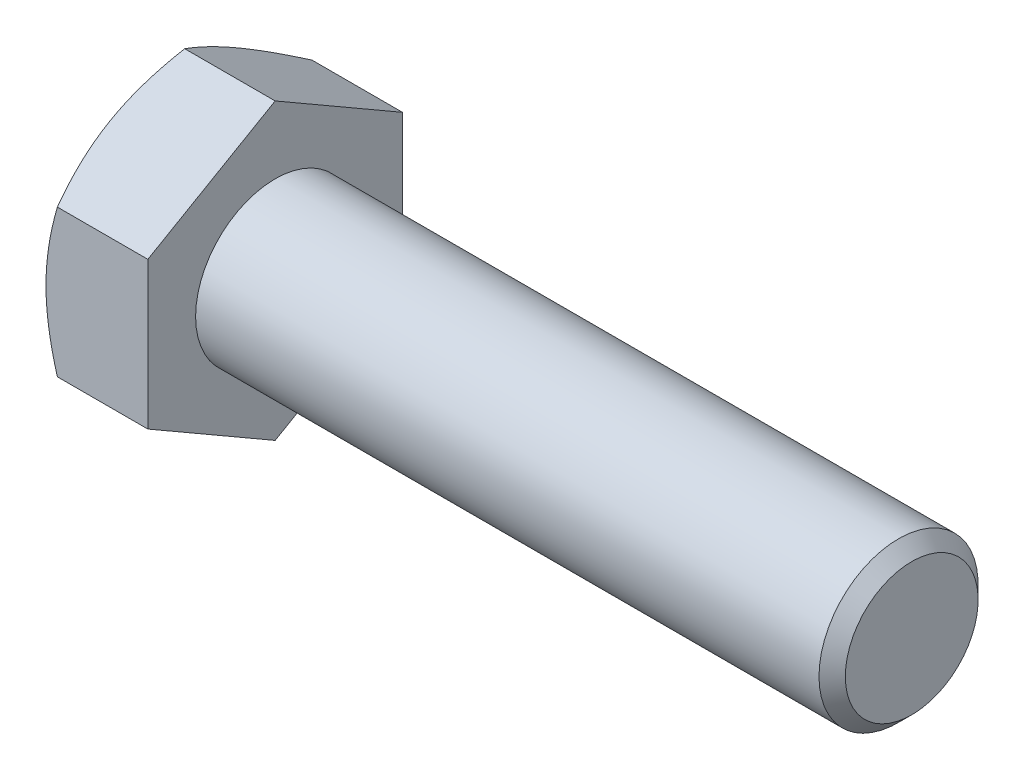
from build123d import *

# Parameters (mm, degrees)
BASEHEAD_DEPTH = 6.4


with BuildPart() as part:
    # Sketch1 → BaseHead (new body)
    with BuildSketch(Plane(origin=(0, 0, 0), x_dir=(0, 0, -1), z_dir=(1, 0, 0))):
        Polygon((8, 4.618802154), (8, -4.618802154), (0, -9.237604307), (-8, -4.618802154), (-8, 4.618802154), (0, 9.237604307), align=None)
    extrude(amount=BASEHEAD_DEPTH)

    # BodySke → BaseBody (revolve)
    with BuildSketch(Plane.XY, mode=Mode.PRIVATE) as basebody_sk:
        Polygon((0, 0), (46.4, 0), (46.4, 4.172), (45.572, 5), (0, 5), align=None)
    revolve(basebody_sk.sketch.rotate(Axis((0, 0, 0), (1, 0, 0)), 90), axis=Axis((0, 0, 0), (1, 0, 0)))

    # Sketch3 → HeadChamfer (revolve, cut)
    with BuildSketch(Plane.XY):
        Polygon((0, 8), (3.601282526, 14.237604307), (3.601282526, 19.237604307), (-10, 19.237604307), (-10, 8), align=None)
    revolve(axis=Axis((0, 0, 0), (1, 0, 0)), mode=Mode.SUBTRACT)


solid = part.part
